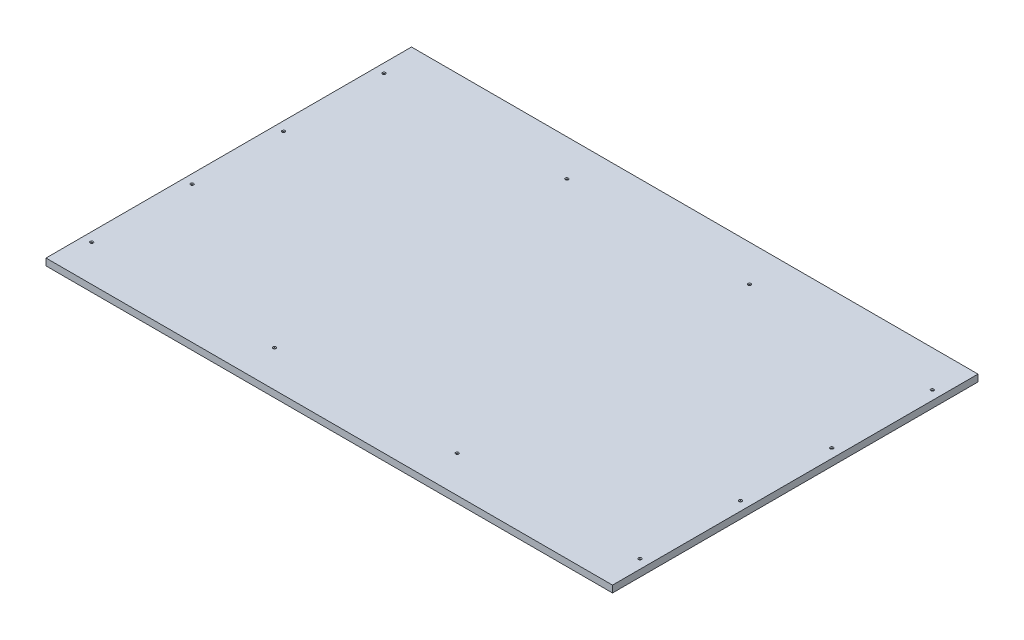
ISO-10303-21;
HEADER;
FILE_DESCRIPTION(('STEP AP214'),'2;1');
FILE_NAME('part.step','',(''),(''),'','','');
FILE_SCHEMA(('AUTOMOTIVE_DESIGN { 1 0 10303 214 1 1 1 1 }'));
ENDSEC;
DATA;
#1=APPLICATION_CONTEXT('core data for automotive mechanical design processes');
#2=APPLICATION_PROTOCOL_DEFINITION('international standard','automotive_design',2000,#1);
#3=PRODUCT_CONTEXT('',#1,'mechanical');
#4=PRODUCT('Part','Part','',(#3));
#5=PRODUCT_RELATED_PRODUCT_CATEGORY('part','',(#4));
#6=PRODUCT_DEFINITION_FORMATION('','',#4);
#7=PRODUCT_DEFINITION_CONTEXT('part definition',#1,'design');
#8=PRODUCT_DEFINITION('design','',#6,#7);
#9=PRODUCT_DEFINITION_SHAPE('','',#8);
#10=(LENGTH_UNIT() NAMED_UNIT(*) SI_UNIT(.MILLI.,.METRE.));
#11=(NAMED_UNIT(*) PLANE_ANGLE_UNIT() SI_UNIT($,.RADIAN.));
#12=(NAMED_UNIT(*) SI_UNIT($,.STERADIAN.) SOLID_ANGLE_UNIT());
#13=UNCERTAINTY_MEASURE_WITH_UNIT(LENGTH_MEASURE(1.E-05),#10,'distance_accuracy_value','');
#14=(GEOMETRIC_REPRESENTATION_CONTEXT(3) GLOBAL_UNCERTAINTY_ASSIGNED_CONTEXT((#13)) GLOBAL_UNIT_ASSIGNED_CONTEXT((#10,
#11,#12)) REPRESENTATION_CONTEXT('',''));
#15=CARTESIAN_POINT('',(0.,0.,0.));
#16=DIRECTION('',(0.,0.,1.));
#17=DIRECTION('',(1.,0.,0.));
#18=AXIS2_PLACEMENT_3D('',#15,#16,#17);
#19=CARTESIAN_POINT('',(-1219.2,19.05,-609.6));
#20=DIRECTION('',(0.,0.,1.));
#21=DIRECTION('',(1.,0.,0.));
#22=AXIS2_PLACEMENT_3D('',#19,#20,#21);
#23=PLANE('',#22);
#24=DIRECTION('',(-1.,0.,0.));
#25=VECTOR('',#24,1.);
#26=CARTESIAN_POINT('',(-1219.2,19.05,-609.6));
#27=LINE('',#26,#25);
#28=CARTESIAN_POINT('',(355.6,19.05,-609.6));
#29=VERTEX_POINT('',#28);
#30=CARTESIAN_POINT('',(-1219.2,19.05,-609.6));
#31=VERTEX_POINT('',#30);
#32=EDGE_CURVE('E55',#29,#31,#27,.T.);
#33=ORIENTED_EDGE('',*,*,#32,.F.);
#34=DIRECTION('',(0.,1.,0.));
#35=VECTOR('',#34,1.);
#36=CARTESIAN_POINT('',(355.6,0.,-609.6));
#37=LINE('',#36,#35);
#38=CARTESIAN_POINT('',(355.6,0.,-609.6));
#39=VERTEX_POINT('',#38);
#40=EDGE_CURVE('E93',#39,#29,#37,.T.);
#41=ORIENTED_EDGE('',*,*,#40,.F.);
#42=DIRECTION('',(-1.,0.,0.));
#43=VECTOR('',#42,1.);
#44=CARTESIAN_POINT('',(-1219.2,0.,-609.6));
#45=LINE('',#44,#43);
#46=CARTESIAN_POINT('',(-1219.2,0.,-609.6));
#47=VERTEX_POINT('',#46);
#48=EDGE_CURVE('E91',#39,#47,#45,.T.);
#49=ORIENTED_EDGE('',*,*,#48,.T.);
#50=DIRECTION('',(0.,-1.,0.));
#51=VECTOR('',#50,1.);
#52=CARTESIAN_POINT('',(-1219.2,19.05,-609.6));
#53=LINE('',#52,#51);
#54=EDGE_CURVE('E11',#31,#47,#53,.T.);
#55=ORIENTED_EDGE('',*,*,#54,.F.);
#56=EDGE_LOOP('',(#33,#41,#49,#55));
#57=FACE_BOUND('',#56,.T.);
#58=ADVANCED_FACE('F32',(#57),#23,.F.);
#59=CARTESIAN_POINT('',(-1219.2,19.05,-609.6));
#60=DIRECTION('',(1.,0.,0.));
#61=DIRECTION('',(0.,0.,-1.));
#62=AXIS2_PLACEMENT_3D('',#59,#60,#61);
#63=PLANE('',#62);
#64=DIRECTION('',(0.,0.,1.));
#65=VECTOR('',#64,1.);
#66=CARTESIAN_POINT('',(-1219.2,0.,-609.6));
#67=LINE('',#66,#65);
#68=CARTESIAN_POINT('',(-1219.2,0.,406.4));
#69=VERTEX_POINT('',#68);
#70=EDGE_CURVE('E87',#47,#69,#67,.T.);
#71=ORIENTED_EDGE('',*,*,#70,.T.);
#72=DIRECTION('',(0.,1.,0.));
#73=VECTOR('',#72,1.);
#74=CARTESIAN_POINT('',(-1219.2,0.,406.4));
#75=LINE('',#74,#73);
#76=CARTESIAN_POINT('',(-1219.2,19.05,406.4));
#77=VERTEX_POINT('',#76);
#78=EDGE_CURVE('E72',#69,#77,#75,.T.);
#79=ORIENTED_EDGE('',*,*,#78,.T.);
#80=DIRECTION('',(0.,0.,1.));
#81=VECTOR('',#80,1.);
#82=CARTESIAN_POINT('',(-1219.2,19.05,-609.6));
#83=LINE('',#82,#81);
#84=EDGE_CURVE('E39',#31,#77,#83,.T.);
#85=ORIENTED_EDGE('',*,*,#84,.F.);
#86=ORIENTED_EDGE('',*,*,#54,.T.);
#87=EDGE_LOOP('',(#71,#79,#85,#86));
#88=FACE_BOUND('',#87,.T.);
#89=ADVANCED_FACE('F90',(#88),#63,.F.);
#90=CARTESIAN_POINT('',(0.,19.05,0.));
#91=DIRECTION('',(0.,1.,0.));
#92=DIRECTION('',(0.,0.,1.));
#93=AXIS2_PLACEMENT_3D('',#90,#91,#92);
#94=PLANE('',#93);
#95=CARTESIAN_POINT('',(-1193.8,19.05,-228.6));
#96=DIRECTION('',(0.,1.,0.));
#97=DIRECTION('',(0.,0.,1.));
#98=AXIS2_PLACEMENT_3D('',#95,#96,#97);
#99=CIRCLE('',#98,4.21640000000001);
#100=CARTESIAN_POINT('',(-1193.8,19.05,-224.3836));
#101=VERTEX_POINT('',#100);
#102=EDGE_CURVE('E208',#101,#101,#99,.T.);
#103=ORIENTED_EDGE('',*,*,#102,.F.);
#104=EDGE_LOOP('',(#103));
#105=FACE_BOUND('',#104,.T.);
#106=CARTESIAN_POINT('',(-1193.8,19.05,25.4000000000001));
#107=DIRECTION('',(0.,1.,0.));
#108=DIRECTION('',(0.,0.,1.));
#109=AXIS2_PLACEMENT_3D('',#106,#107,#108);
#110=CIRCLE('',#109,4.21640000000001);
#111=CARTESIAN_POINT('',(-1193.8,19.05,29.6164000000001));
#112=VERTEX_POINT('',#111);
#113=EDGE_CURVE('E199',#112,#112,#110,.T.);
#114=ORIENTED_EDGE('',*,*,#113,.F.);
#115=EDGE_LOOP('',(#114));
#116=FACE_BOUND('',#115,.T.);
#117=CARTESIAN_POINT('',(330.200000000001,19.05,25.4000000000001));
#118=DIRECTION('',(0.,1.,0.));
#119=DIRECTION('',(0.,0.,1.));
#120=AXIS2_PLACEMENT_3D('',#117,#118,#119);
#121=CIRCLE('',#120,4.21640000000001);
#122=CARTESIAN_POINT('',(330.200000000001,19.05,29.6164000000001));
#123=VERTEX_POINT('',#122);
#124=EDGE_CURVE('E190',#123,#123,#121,.T.);
#125=ORIENTED_EDGE('',*,*,#124,.F.);
#126=EDGE_LOOP('',(#125));
#127=FACE_BOUND('',#126,.T.);
#128=CARTESIAN_POINT('',(330.200000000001,19.05,-228.6));
#129=DIRECTION('',(0.,1.,0.));
#130=DIRECTION('',(0.,0.,1.));
#131=AXIS2_PLACEMENT_3D('',#128,#129,#130);
#132=CIRCLE('',#131,4.21640000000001);
#133=CARTESIAN_POINT('',(330.200000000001,19.05,-224.3836));
#134=VERTEX_POINT('',#133);
#135=EDGE_CURVE('E181',#134,#134,#132,.T.);
#136=ORIENTED_EDGE('',*,*,#135,.F.);
#137=EDGE_LOOP('',(#136));
#138=FACE_BOUND('',#137,.T.);
#139=CARTESIAN_POINT('',(-1193.8,19.05,-508.));
#140=DIRECTION('',(0.,1.,0.));
#141=DIRECTION('',(0.,0.,1.));
#142=AXIS2_PLACEMENT_3D('',#139,#140,#141);
#143=CIRCLE('',#142,4.21640000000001);
#144=CARTESIAN_POINT('',(-1193.8,19.05,-503.7836));
#145=VERTEX_POINT('',#144);
#146=EDGE_CURVE('E172',#145,#145,#143,.T.);
#147=ORIENTED_EDGE('',*,*,#146,.F.);
#148=EDGE_LOOP('',(#147));
#149=FACE_BOUND('',#148,.T.);
#150=CARTESIAN_POINT('',(-685.8,19.05,-508.));
#151=DIRECTION('',(0.,1.,0.));
#152=DIRECTION('',(0.,0.,1.));
#153=AXIS2_PLACEMENT_3D('',#150,#151,#152);
#154=CIRCLE('',#153,4.21640000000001);
#155=CARTESIAN_POINT('',(-685.8,19.05,-503.7836));
#156=VERTEX_POINT('',#155);
#157=EDGE_CURVE('E163',#156,#156,#154,.T.);
#158=ORIENTED_EDGE('',*,*,#157,.F.);
#159=EDGE_LOOP('',(#158));
#160=FACE_BOUND('',#159,.T.);
#161=CARTESIAN_POINT('',(-177.8,19.05,-508.));
#162=DIRECTION('',(0.,1.,0.));
#163=DIRECTION('',(0.,0.,1.));
#164=AXIS2_PLACEMENT_3D('',#161,#162,#163);
#165=CIRCLE('',#164,4.21640000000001);
#166=CARTESIAN_POINT('',(-177.8,19.05,-503.7836));
#167=VERTEX_POINT('',#166);
#168=EDGE_CURVE('E154',#167,#167,#165,.T.);
#169=ORIENTED_EDGE('',*,*,#168,.F.);
#170=EDGE_LOOP('',(#169));
#171=FACE_BOUND('',#170,.T.);
#172=CARTESIAN_POINT('',(330.2,19.05,-508.));
#173=DIRECTION('',(0.,1.,0.));
#174=DIRECTION('',(0.,0.,1.));
#175=AXIS2_PLACEMENT_3D('',#172,#173,#174);
#176=CIRCLE('',#175,4.21640000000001);
#177=CARTESIAN_POINT('',(330.2,19.05,-503.7836));
#178=VERTEX_POINT('',#177);
#179=EDGE_CURVE('E145',#178,#178,#176,.T.);
#180=ORIENTED_EDGE('',*,*,#179,.F.);
#181=EDGE_LOOP('',(#180));
#182=FACE_BOUND('',#181,.T.);
#183=CARTESIAN_POINT('',(-1193.8,19.05,304.8));
#184=DIRECTION('',(0.,1.,0.));
#185=DIRECTION('',(0.,0.,1.));
#186=AXIS2_PLACEMENT_3D('',#183,#184,#185);
#187=CIRCLE('',#186,4.21640000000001);
#188=CARTESIAN_POINT('',(-1193.8,19.05,309.0164));
#189=VERTEX_POINT('',#188);
#190=EDGE_CURVE('E136',#189,#189,#187,.T.);
#191=ORIENTED_EDGE('',*,*,#190,.F.);
#192=EDGE_LOOP('',(#191));
#193=FACE_BOUND('',#192,.T.);
#194=CARTESIAN_POINT('',(-685.8,19.05,304.8));
#195=DIRECTION('',(0.,1.,0.));
#196=DIRECTION('',(0.,0.,1.));
#197=AXIS2_PLACEMENT_3D('',#194,#195,#196);
#198=CIRCLE('',#197,4.21640000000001);
#199=CARTESIAN_POINT('',(-685.8,19.05,309.0164));
#200=VERTEX_POINT('',#199);
#201=EDGE_CURVE('E127',#200,#200,#198,.T.);
#202=ORIENTED_EDGE('',*,*,#201,.F.);
#203=EDGE_LOOP('',(#202));
#204=FACE_BOUND('',#203,.T.);
#205=CARTESIAN_POINT('',(-177.799999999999,19.05,304.8));
#206=DIRECTION('',(0.,1.,0.));
#207=DIRECTION('',(0.,0.,1.));
#208=AXIS2_PLACEMENT_3D('',#205,#206,#207);
#209=CIRCLE('',#208,4.21640000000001);
#210=CARTESIAN_POINT('',(-177.799999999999,19.05,309.0164));
#211=VERTEX_POINT('',#210);
#212=EDGE_CURVE('E118',#211,#211,#209,.T.);
#213=ORIENTED_EDGE('',*,*,#212,.F.);
#214=EDGE_LOOP('',(#213));
#215=FACE_BOUND('',#214,.T.);
#216=CARTESIAN_POINT('',(330.200000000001,19.05,304.8));
#217=DIRECTION('',(0.,1.,0.));
#218=DIRECTION('',(0.,0.,1.));
#219=AXIS2_PLACEMENT_3D('',#216,#217,#218);
#220=CIRCLE('',#219,4.21640000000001);
#221=CARTESIAN_POINT('',(330.200000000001,19.05,309.0164));
#222=VERTEX_POINT('',#221);
#223=EDGE_CURVE('E109',#222,#222,#220,.T.);
#224=ORIENTED_EDGE('',*,*,#223,.F.);
#225=EDGE_LOOP('',(#224));
#226=FACE_BOUND('',#225,.T.);
#227=DIRECTION('',(-1.,0.,0.));
#228=VECTOR('',#227,1.);
#229=CARTESIAN_POINT('',(-1219.2,19.05,406.4));
#230=LINE('',#229,#228);
#231=CARTESIAN_POINT('',(355.6,19.05,406.4));
#232=VERTEX_POINT('',#231);
#233=EDGE_CURVE('E75',#232,#77,#230,.T.);
#234=ORIENTED_EDGE('',*,*,#233,.F.);
#235=DIRECTION('',(0.,0.,1.));
#236=VECTOR('',#235,1.);
#237=CARTESIAN_POINT('',(355.6,19.05,-609.6));
#238=LINE('',#237,#236);
#239=EDGE_CURVE('E79',#29,#232,#238,.T.);
#240=ORIENTED_EDGE('',*,*,#239,.F.);
#241=ORIENTED_EDGE('',*,*,#32,.T.);
#242=ORIENTED_EDGE('',*,*,#84,.T.);
#243=EDGE_LOOP('',(#234,#240,#241,#242));
#244=FACE_BOUND('',#243,.T.);
#245=ADVANCED_FACE('F214',(#105,#116,#127,#138,#149,#160,#171,#182,#193,#204,#215,#226,#244),
#94,.T.);
#246=CARTESIAN_POINT('',(0.,0.,0.));
#247=DIRECTION('',(0.,1.,0.));
#248=DIRECTION('',(0.,0.,1.));
#249=AXIS2_PLACEMENT_3D('',#246,#247,#248);
#250=PLANE('',#249);
#251=CARTESIAN_POINT('',(-1193.8,0.,-228.6));
#252=DIRECTION('',(0.,1.,0.));
#253=DIRECTION('',(0.,0.,1.));
#254=AXIS2_PLACEMENT_3D('',#251,#252,#253);
#255=CIRCLE('',#254,2.24789999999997);
#256=CARTESIAN_POINT('',(-1193.8,0.,-226.3521));
#257=VERTEX_POINT('',#256);
#258=EDGE_CURVE('E202',#257,#257,#255,.T.);
#259=ORIENTED_EDGE('',*,*,#258,.T.);
#260=EDGE_LOOP('',(#259));
#261=FACE_BOUND('',#260,.T.);
#262=CARTESIAN_POINT('',(-1193.8,0.,25.4000000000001));
#263=DIRECTION('',(0.,1.,0.));
#264=DIRECTION('',(0.,0.,1.));
#265=AXIS2_PLACEMENT_3D('',#262,#263,#264);
#266=CIRCLE('',#265,2.24789999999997);
#267=CARTESIAN_POINT('',(-1193.8,0.,27.6479000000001));
#268=VERTEX_POINT('',#267);
#269=EDGE_CURVE('E193',#268,#268,#266,.T.);
#270=ORIENTED_EDGE('',*,*,#269,.T.);
#271=EDGE_LOOP('',(#270));
#272=FACE_BOUND('',#271,.T.);
#273=CARTESIAN_POINT('',(330.200000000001,0.,25.4000000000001));
#274=DIRECTION('',(0.,1.,0.));
#275=DIRECTION('',(0.,0.,1.));
#276=AXIS2_PLACEMENT_3D('',#273,#274,#275);
#277=CIRCLE('',#276,2.24789999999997);
#278=CARTESIAN_POINT('',(330.200000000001,0.,27.6479000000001));
#279=VERTEX_POINT('',#278);
#280=EDGE_CURVE('E184',#279,#279,#277,.T.);
#281=ORIENTED_EDGE('',*,*,#280,.T.);
#282=EDGE_LOOP('',(#281));
#283=FACE_BOUND('',#282,.T.);
#284=CARTESIAN_POINT('',(330.200000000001,0.,-228.6));
#285=DIRECTION('',(0.,1.,0.));
#286=DIRECTION('',(0.,0.,1.));
#287=AXIS2_PLACEMENT_3D('',#284,#285,#286);
#288=CIRCLE('',#287,2.24789999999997);
#289=CARTESIAN_POINT('',(330.200000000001,0.,-226.3521));
#290=VERTEX_POINT('',#289);
#291=EDGE_CURVE('E175',#290,#290,#288,.T.);
#292=ORIENTED_EDGE('',*,*,#291,.T.);
#293=EDGE_LOOP('',(#292));
#294=FACE_BOUND('',#293,.T.);
#295=CARTESIAN_POINT('',(-1193.8,0.,-508.));
#296=DIRECTION('',(0.,1.,0.));
#297=DIRECTION('',(0.,0.,1.));
#298=AXIS2_PLACEMENT_3D('',#295,#296,#297);
#299=CIRCLE('',#298,2.24789999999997);
#300=CARTESIAN_POINT('',(-1193.8,0.,-505.7521));
#301=VERTEX_POINT('',#300);
#302=EDGE_CURVE('E166',#301,#301,#299,.T.);
#303=ORIENTED_EDGE('',*,*,#302,.T.);
#304=EDGE_LOOP('',(#303));
#305=FACE_BOUND('',#304,.T.);
#306=CARTESIAN_POINT('',(-685.8,0.,-508.));
#307=DIRECTION('',(0.,1.,0.));
#308=DIRECTION('',(0.,0.,1.));
#309=AXIS2_PLACEMENT_3D('',#306,#307,#308);
#310=CIRCLE('',#309,2.24789999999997);
#311=CARTESIAN_POINT('',(-685.8,0.,-505.7521));
#312=VERTEX_POINT('',#311);
#313=EDGE_CURVE('E157',#312,#312,#310,.T.);
#314=ORIENTED_EDGE('',*,*,#313,.T.);
#315=EDGE_LOOP('',(#314));
#316=FACE_BOUND('',#315,.T.);
#317=CARTESIAN_POINT('',(-177.8,0.,-508.));
#318=DIRECTION('',(0.,1.,0.));
#319=DIRECTION('',(0.,0.,1.));
#320=AXIS2_PLACEMENT_3D('',#317,#318,#319);
#321=CIRCLE('',#320,2.2479);
#322=CARTESIAN_POINT('',(-177.8,0.,-505.7521));
#323=VERTEX_POINT('',#322);
#324=EDGE_CURVE('E148',#323,#323,#321,.T.);
#325=ORIENTED_EDGE('',*,*,#324,.T.);
#326=EDGE_LOOP('',(#325));
#327=FACE_BOUND('',#326,.T.);
#328=CARTESIAN_POINT('',(330.2,0.,-508.));
#329=DIRECTION('',(0.,1.,0.));
#330=DIRECTION('',(0.,0.,1.));
#331=AXIS2_PLACEMENT_3D('',#328,#329,#330);
#332=CIRCLE('',#331,2.24789999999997);
#333=CARTESIAN_POINT('',(330.2,0.,-505.7521));
#334=VERTEX_POINT('',#333);
#335=EDGE_CURVE('E139',#334,#334,#332,.T.);
#336=ORIENTED_EDGE('',*,*,#335,.T.);
#337=EDGE_LOOP('',(#336));
#338=FACE_BOUND('',#337,.T.);
#339=CARTESIAN_POINT('',(-1193.8,0.,304.8));
#340=DIRECTION('',(0.,1.,0.));
#341=DIRECTION('',(0.,0.,1.));
#342=AXIS2_PLACEMENT_3D('',#339,#340,#341);
#343=CIRCLE('',#342,2.24789999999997);
#344=CARTESIAN_POINT('',(-1193.8,0.,307.0479));
#345=VERTEX_POINT('',#344);
#346=EDGE_CURVE('E130',#345,#345,#343,.T.);
#347=ORIENTED_EDGE('',*,*,#346,.T.);
#348=EDGE_LOOP('',(#347));
#349=FACE_BOUND('',#348,.T.);
#350=CARTESIAN_POINT('',(-685.8,0.,304.8));
#351=DIRECTION('',(0.,1.,0.));
#352=DIRECTION('',(0.,0.,1.));
#353=AXIS2_PLACEMENT_3D('',#350,#351,#352);
#354=CIRCLE('',#353,2.24789999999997);
#355=CARTESIAN_POINT('',(-685.8,0.,307.0479));
#356=VERTEX_POINT('',#355);
#357=EDGE_CURVE('E121',#356,#356,#354,.T.);
#358=ORIENTED_EDGE('',*,*,#357,.T.);
#359=EDGE_LOOP('',(#358));
#360=FACE_BOUND('',#359,.T.);
#361=CARTESIAN_POINT('',(-177.799999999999,0.,304.8));
#362=DIRECTION('',(0.,1.,0.));
#363=DIRECTION('',(0.,0.,1.));
#364=AXIS2_PLACEMENT_3D('',#361,#362,#363);
#365=CIRCLE('',#364,2.2479);
#366=CARTESIAN_POINT('',(-177.799999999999,0.,307.0479));
#367=VERTEX_POINT('',#366);
#368=EDGE_CURVE('E112',#367,#367,#365,.T.);
#369=ORIENTED_EDGE('',*,*,#368,.T.);
#370=EDGE_LOOP('',(#369));
#371=FACE_BOUND('',#370,.T.);
#372=CARTESIAN_POINT('',(330.200000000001,0.,304.8));
#373=DIRECTION('',(0.,1.,0.));
#374=DIRECTION('',(0.,0.,1.));
#375=AXIS2_PLACEMENT_3D('',#372,#373,#374);
#376=CIRCLE('',#375,2.24789999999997);
#377=CARTESIAN_POINT('',(330.200000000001,0.,307.0479));
#378=VERTEX_POINT('',#377);
#379=EDGE_CURVE('E102',#378,#378,#376,.T.);
#380=ORIENTED_EDGE('',*,*,#379,.T.);
#381=EDGE_LOOP('',(#380));
#382=FACE_BOUND('',#381,.T.);
#383=DIRECTION('',(0.,0.,1.));
#384=VECTOR('',#383,1.);
#385=CARTESIAN_POINT('',(355.6,0.,-609.6));
#386=LINE('',#385,#384);
#387=CARTESIAN_POINT('',(355.600000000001,0.,406.4));
#388=VERTEX_POINT('',#387);
#389=EDGE_CURVE('E88',#39,#388,#386,.T.);
#390=ORIENTED_EDGE('',*,*,#389,.T.);
#391=DIRECTION('',(-1.,0.,0.));
#392=VECTOR('',#391,1.);
#393=CARTESIAN_POINT('',(-1219.2,0.,406.4));
#394=LINE('',#393,#392);
#395=EDGE_CURVE('E46',#388,#69,#394,.T.);
#396=ORIENTED_EDGE('',*,*,#395,.T.);
#397=ORIENTED_EDGE('',*,*,#70,.F.);
#398=ORIENTED_EDGE('',*,*,#48,.F.);
#399=EDGE_LOOP('',(#390,#396,#397,#398));
#400=FACE_BOUND('',#399,.T.);
#401=ADVANCED_FACE('F85',(#261,#272,#283,#294,#305,#316,#327,#338,#349,#360,#371,#382,#400),
#250,.F.);
#402=CARTESIAN_POINT('',(355.6,0.,-609.6));
#403=DIRECTION('',(-1.,0.,0.));
#404=DIRECTION('',(0.,0.,1.));
#405=AXIS2_PLACEMENT_3D('',#402,#403,#404);
#406=PLANE('',#405);
#407=ORIENTED_EDGE('',*,*,#239,.T.);
#408=DIRECTION('',(0.,1.,0.));
#409=VECTOR('',#408,1.);
#410=CARTESIAN_POINT('',(355.6,0.,406.4));
#411=LINE('',#410,#409);
#412=EDGE_CURVE('E80',#388,#232,#411,.T.);
#413=ORIENTED_EDGE('',*,*,#412,.F.);
#414=ORIENTED_EDGE('',*,*,#389,.F.);
#415=ORIENTED_EDGE('',*,*,#40,.T.);
#416=EDGE_LOOP('',(#407,#413,#414,#415));
#417=FACE_BOUND('',#416,.T.);
#418=ADVANCED_FACE('F240',(#417),#406,.F.);
#419=CARTESIAN_POINT('',(-1219.2,0.,406.4));
#420=DIRECTION('',(0.,0.,-1.));
#421=DIRECTION('',(-1.,0.,0.));
#422=AXIS2_PLACEMENT_3D('',#419,#420,#421);
#423=PLANE('',#422);
#424=ORIENTED_EDGE('',*,*,#233,.T.);
#425=ORIENTED_EDGE('',*,*,#78,.F.);
#426=ORIENTED_EDGE('',*,*,#395,.F.);
#427=ORIENTED_EDGE('',*,*,#412,.T.);
#428=EDGE_LOOP('',(#424,#425,#426,#427));
#429=FACE_BOUND('',#428,.T.);
#430=ADVANCED_FACE('F73',(#429),#423,.F.);
#431=CARTESIAN_POINT('',(330.200000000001,19.05,304.8));
#432=DIRECTION('',(0.,1.,0.));
#433=DIRECTION('',(0.,0.,1.));
#434=AXIS2_PLACEMENT_3D('',#431,#432,#433);
#435=CYLINDRICAL_SURFACE('',#434,2.24789999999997);
#436=ORIENTED_EDGE('',*,*,#379,.F.);
#437=EDGE_LOOP('',(#436));
#438=FACE_BOUND('',#437,.T.);
#439=CARTESIAN_POINT('',(330.200000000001,17.3982323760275,304.8));
#440=DIRECTION('',(0.,1.,0.));
#441=DIRECTION('',(0.,0.,1.));
#442=AXIS2_PLACEMENT_3D('',#439,#440,#441);
#443=CIRCLE('',#442,2.24789999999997);
#444=CARTESIAN_POINT('',(330.200000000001,17.3982323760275,307.0479));
#445=VERTEX_POINT('',#444);
#446=EDGE_CURVE('E106',#445,#445,#443,.T.);
#447=ORIENTED_EDGE('',*,*,#446,.T.);
#448=EDGE_LOOP('',(#447));
#449=FACE_BOUND('',#448,.T.);
#450=ADVANCED_FACE('F257',(#438,#449),#435,.F.);
#451=CARTESIAN_POINT('',(330.200000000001,19.05,304.8));
#452=DIRECTION('',(0.,1.,0.));
#453=DIRECTION('',(0.,0.,1.));
#454=AXIS2_PLACEMENT_3D('',#451,#452,#453);
#455=CONICAL_SURFACE('',#454,4.21640000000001,0.872664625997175);
#456=ORIENTED_EDGE('',*,*,#446,.F.);
#457=EDGE_LOOP('',(#456));
#458=FACE_BOUND('',#457,.T.);
#459=ORIENTED_EDGE('',*,*,#223,.T.);
#460=EDGE_LOOP('',(#459));
#461=FACE_BOUND('',#460,.T.);
#462=ADVANCED_FACE('F260',(#458,#461),#455,.F.);
#463=CARTESIAN_POINT('',(-177.799999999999,19.05,304.8));
#464=DIRECTION('',(0.,1.,0.));
#465=DIRECTION('',(0.,0.,1.));
#466=AXIS2_PLACEMENT_3D('',#463,#464,#465);
#467=CYLINDRICAL_SURFACE('',#466,2.2479);
#468=ORIENTED_EDGE('',*,*,#368,.F.);
#469=EDGE_LOOP('',(#468));
#470=FACE_BOUND('',#469,.T.);
#471=CARTESIAN_POINT('',(-177.799999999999,17.3982323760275,304.8));
#472=DIRECTION('',(0.,1.,0.));
#473=DIRECTION('',(0.,0.,1.));
#474=AXIS2_PLACEMENT_3D('',#471,#472,#473);
#475=CIRCLE('',#474,2.2479);
#476=CARTESIAN_POINT('',(-177.799999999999,17.3982323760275,307.0479));
#477=VERTEX_POINT('',#476);
#478=EDGE_CURVE('E115',#477,#477,#475,.T.);
#479=ORIENTED_EDGE('',*,*,#478,.T.);
#480=EDGE_LOOP('',(#479));
#481=FACE_BOUND('',#480,.T.);
#482=ADVANCED_FACE('F264',(#470,#481),#467,.F.);
#483=CARTESIAN_POINT('',(-177.799999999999,19.05,304.8));
#484=DIRECTION('',(0.,1.,0.));
#485=DIRECTION('',(0.,0.,1.));
#486=AXIS2_PLACEMENT_3D('',#483,#484,#485);
#487=CONICAL_SURFACE('',#486,4.21640000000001,0.872664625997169);
#488=ORIENTED_EDGE('',*,*,#478,.F.);
#489=EDGE_LOOP('',(#488));
#490=FACE_BOUND('',#489,.T.);
#491=ORIENTED_EDGE('',*,*,#212,.T.);
#492=EDGE_LOOP('',(#491));
#493=FACE_BOUND('',#492,.T.);
#494=ADVANCED_FACE('F268',(#490,#493),#487,.F.);
#495=CARTESIAN_POINT('',(-685.8,19.05,304.8));
#496=DIRECTION('',(0.,1.,0.));
#497=DIRECTION('',(0.,0.,1.));
#498=AXIS2_PLACEMENT_3D('',#495,#496,#497);
#499=CYLINDRICAL_SURFACE('',#498,2.24789999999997);
#500=ORIENTED_EDGE('',*,*,#357,.F.);
#501=EDGE_LOOP('',(#500));
#502=FACE_BOUND('',#501,.T.);
#503=CARTESIAN_POINT('',(-685.8,17.3982323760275,304.8));
#504=DIRECTION('',(0.,1.,0.));
#505=DIRECTION('',(0.,0.,1.));
#506=AXIS2_PLACEMENT_3D('',#503,#504,#505);
#507=CIRCLE('',#506,2.24789999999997);
#508=CARTESIAN_POINT('',(-685.8,17.3982323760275,307.0479));
#509=VERTEX_POINT('',#508);
#510=EDGE_CURVE('E124',#509,#509,#507,.T.);
#511=ORIENTED_EDGE('',*,*,#510,.T.);
#512=EDGE_LOOP('',(#511));
#513=FACE_BOUND('',#512,.T.);
#514=ADVANCED_FACE('F272',(#502,#513),#499,.F.);
#515=CARTESIAN_POINT('',(-685.8,19.05,304.8));
#516=DIRECTION('',(0.,1.,0.));
#517=DIRECTION('',(0.,0.,1.));
#518=AXIS2_PLACEMENT_3D('',#515,#516,#517);
#519=CONICAL_SURFACE('',#518,4.21640000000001,0.872664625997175);
#520=ORIENTED_EDGE('',*,*,#510,.F.);
#521=EDGE_LOOP('',(#520));
#522=FACE_BOUND('',#521,.T.);
#523=ORIENTED_EDGE('',*,*,#201,.T.);
#524=EDGE_LOOP('',(#523));
#525=FACE_BOUND('',#524,.T.);
#526=ADVANCED_FACE('F276',(#522,#525),#519,.F.);
#527=CARTESIAN_POINT('',(-1193.8,19.05,304.8));
#528=DIRECTION('',(0.,1.,0.));
#529=DIRECTION('',(0.,0.,1.));
#530=AXIS2_PLACEMENT_3D('',#527,#528,#529);
#531=CYLINDRICAL_SURFACE('',#530,2.24789999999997);
#532=ORIENTED_EDGE('',*,*,#346,.F.);
#533=EDGE_LOOP('',(#532));
#534=FACE_BOUND('',#533,.T.);
#535=CARTESIAN_POINT('',(-1193.8,17.3982323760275,304.8));
#536=DIRECTION('',(0.,1.,0.));
#537=DIRECTION('',(0.,0.,1.));
#538=AXIS2_PLACEMENT_3D('',#535,#536,#537);
#539=CIRCLE('',#538,2.24789999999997);
#540=CARTESIAN_POINT('',(-1193.8,17.3982323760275,307.0479));
#541=VERTEX_POINT('',#540);
#542=EDGE_CURVE('E133',#541,#541,#539,.T.);
#543=ORIENTED_EDGE('',*,*,#542,.T.);
#544=EDGE_LOOP('',(#543));
#545=FACE_BOUND('',#544,.T.);
#546=ADVANCED_FACE('F280',(#534,#545),#531,.F.);
#547=CARTESIAN_POINT('',(-1193.8,19.05,304.8));
#548=DIRECTION('',(0.,1.,0.));
#549=DIRECTION('',(0.,0.,1.));
#550=AXIS2_PLACEMENT_3D('',#547,#548,#549);
#551=CONICAL_SURFACE('',#550,4.21640000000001,0.872664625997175);
#552=ORIENTED_EDGE('',*,*,#542,.F.);
#553=EDGE_LOOP('',(#552));
#554=FACE_BOUND('',#553,.T.);
#555=ORIENTED_EDGE('',*,*,#190,.T.);
#556=EDGE_LOOP('',(#555));
#557=FACE_BOUND('',#556,.T.);
#558=ADVANCED_FACE('F284',(#554,#557),#551,.F.);
#559=CARTESIAN_POINT('',(330.2,19.05,-508.));
#560=DIRECTION('',(0.,1.,0.));
#561=DIRECTION('',(0.,0.,1.));
#562=AXIS2_PLACEMENT_3D('',#559,#560,#561);
#563=CYLINDRICAL_SURFACE('',#562,2.24789999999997);
#564=ORIENTED_EDGE('',*,*,#335,.F.);
#565=EDGE_LOOP('',(#564));
#566=FACE_BOUND('',#565,.T.);
#567=CARTESIAN_POINT('',(330.2,17.3982323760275,-508.));
#568=DIRECTION('',(0.,1.,0.));
#569=DIRECTION('',(0.,0.,1.));
#570=AXIS2_PLACEMENT_3D('',#567,#568,#569);
#571=CIRCLE('',#570,2.24789999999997);
#572=CARTESIAN_POINT('',(330.2,17.3982323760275,-505.7521));
#573=VERTEX_POINT('',#572);
#574=EDGE_CURVE('E142',#573,#573,#571,.T.);
#575=ORIENTED_EDGE('',*,*,#574,.T.);
#576=EDGE_LOOP('',(#575));
#577=FACE_BOUND('',#576,.T.);
#578=ADVANCED_FACE('F288',(#566,#577),#563,.F.);
#579=CARTESIAN_POINT('',(330.2,19.05,-508.));
#580=DIRECTION('',(0.,1.,0.));
#581=DIRECTION('',(0.,0.,1.));
#582=AXIS2_PLACEMENT_3D('',#579,#580,#581);
#583=CONICAL_SURFACE('',#582,4.21640000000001,0.872664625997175);
#584=ORIENTED_EDGE('',*,*,#574,.F.);
#585=EDGE_LOOP('',(#584));
#586=FACE_BOUND('',#585,.T.);
#587=ORIENTED_EDGE('',*,*,#179,.T.);
#588=EDGE_LOOP('',(#587));
#589=FACE_BOUND('',#588,.T.);
#590=ADVANCED_FACE('F292',(#586,#589),#583,.F.);
#591=CARTESIAN_POINT('',(-177.8,19.05,-508.));
#592=DIRECTION('',(0.,1.,0.));
#593=DIRECTION('',(0.,0.,1.));
#594=AXIS2_PLACEMENT_3D('',#591,#592,#593);
#595=CYLINDRICAL_SURFACE('',#594,2.2479);
#596=ORIENTED_EDGE('',*,*,#324,.F.);
#597=EDGE_LOOP('',(#596));
#598=FACE_BOUND('',#597,.T.);
#599=CARTESIAN_POINT('',(-177.8,17.3982323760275,-508.));
#600=DIRECTION('',(0.,1.,0.));
#601=DIRECTION('',(0.,0.,1.));
#602=AXIS2_PLACEMENT_3D('',#599,#600,#601);
#603=CIRCLE('',#602,2.2479);
#604=CARTESIAN_POINT('',(-177.8,17.3982323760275,-505.7521));
#605=VERTEX_POINT('',#604);
#606=EDGE_CURVE('E151',#605,#605,#603,.T.);
#607=ORIENTED_EDGE('',*,*,#606,.T.);
#608=EDGE_LOOP('',(#607));
#609=FACE_BOUND('',#608,.T.);
#610=ADVANCED_FACE('F296',(#598,#609),#595,.F.);
#611=CARTESIAN_POINT('',(-177.8,19.05,-508.));
#612=DIRECTION('',(0.,1.,0.));
#613=DIRECTION('',(0.,0.,1.));
#614=AXIS2_PLACEMENT_3D('',#611,#612,#613);
#615=CONICAL_SURFACE('',#614,4.21640000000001,0.872664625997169);
#616=ORIENTED_EDGE('',*,*,#606,.F.);
#617=EDGE_LOOP('',(#616));
#618=FACE_BOUND('',#617,.T.);
#619=ORIENTED_EDGE('',*,*,#168,.T.);
#620=EDGE_LOOP('',(#619));
#621=FACE_BOUND('',#620,.T.);
#622=ADVANCED_FACE('F300',(#618,#621),#615,.F.);
#623=CARTESIAN_POINT('',(-685.8,19.05,-508.));
#624=DIRECTION('',(0.,1.,0.));
#625=DIRECTION('',(0.,0.,1.));
#626=AXIS2_PLACEMENT_3D('',#623,#624,#625);
#627=CYLINDRICAL_SURFACE('',#626,2.24789999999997);
#628=ORIENTED_EDGE('',*,*,#313,.F.);
#629=EDGE_LOOP('',(#628));
#630=FACE_BOUND('',#629,.T.);
#631=CARTESIAN_POINT('',(-685.8,17.3982323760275,-508.));
#632=DIRECTION('',(0.,1.,0.));
#633=DIRECTION('',(0.,0.,1.));
#634=AXIS2_PLACEMENT_3D('',#631,#632,#633);
#635=CIRCLE('',#634,2.24789999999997);
#636=CARTESIAN_POINT('',(-685.8,17.3982323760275,-505.7521));
#637=VERTEX_POINT('',#636);
#638=EDGE_CURVE('E160',#637,#637,#635,.T.);
#639=ORIENTED_EDGE('',*,*,#638,.T.);
#640=EDGE_LOOP('',(#639));
#641=FACE_BOUND('',#640,.T.);
#642=ADVANCED_FACE('F304',(#630,#641),#627,.F.);
#643=CARTESIAN_POINT('',(-685.8,19.05,-508.));
#644=DIRECTION('',(0.,1.,0.));
#645=DIRECTION('',(0.,0.,1.));
#646=AXIS2_PLACEMENT_3D('',#643,#644,#645);
#647=CONICAL_SURFACE('',#646,4.21640000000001,0.872664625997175);
#648=ORIENTED_EDGE('',*,*,#638,.F.);
#649=EDGE_LOOP('',(#648));
#650=FACE_BOUND('',#649,.T.);
#651=ORIENTED_EDGE('',*,*,#157,.T.);
#652=EDGE_LOOP('',(#651));
#653=FACE_BOUND('',#652,.T.);
#654=ADVANCED_FACE('F308',(#650,#653),#647,.F.);
#655=CARTESIAN_POINT('',(-1193.8,19.05,-508.));
#656=DIRECTION('',(0.,1.,0.));
#657=DIRECTION('',(0.,0.,1.));
#658=AXIS2_PLACEMENT_3D('',#655,#656,#657);
#659=CYLINDRICAL_SURFACE('',#658,2.24789999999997);
#660=ORIENTED_EDGE('',*,*,#302,.F.);
#661=EDGE_LOOP('',(#660));
#662=FACE_BOUND('',#661,.T.);
#663=CARTESIAN_POINT('',(-1193.8,17.3982323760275,-508.));
#664=DIRECTION('',(0.,1.,0.));
#665=DIRECTION('',(0.,0.,1.));
#666=AXIS2_PLACEMENT_3D('',#663,#664,#665);
#667=CIRCLE('',#666,2.24789999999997);
#668=CARTESIAN_POINT('',(-1193.8,17.3982323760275,-505.7521));
#669=VERTEX_POINT('',#668);
#670=EDGE_CURVE('E169',#669,#669,#667,.T.);
#671=ORIENTED_EDGE('',*,*,#670,.T.);
#672=EDGE_LOOP('',(#671));
#673=FACE_BOUND('',#672,.T.);
#674=ADVANCED_FACE('F312',(#662,#673),#659,.F.);
#675=CARTESIAN_POINT('',(-1193.8,19.05,-508.));
#676=DIRECTION('',(0.,1.,0.));
#677=DIRECTION('',(0.,0.,1.));
#678=AXIS2_PLACEMENT_3D('',#675,#676,#677);
#679=CONICAL_SURFACE('',#678,4.21640000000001,0.872664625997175);
#680=ORIENTED_EDGE('',*,*,#670,.F.);
#681=EDGE_LOOP('',(#680));
#682=FACE_BOUND('',#681,.T.);
#683=ORIENTED_EDGE('',*,*,#146,.T.);
#684=EDGE_LOOP('',(#683));
#685=FACE_BOUND('',#684,.T.);
#686=ADVANCED_FACE('F316',(#682,#685),#679,.F.);
#687=CARTESIAN_POINT('',(330.200000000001,19.05,-228.6));
#688=DIRECTION('',(0.,1.,0.));
#689=DIRECTION('',(0.,0.,1.));
#690=AXIS2_PLACEMENT_3D('',#687,#688,#689);
#691=CYLINDRICAL_SURFACE('',#690,2.24789999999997);
#692=ORIENTED_EDGE('',*,*,#291,.F.);
#693=EDGE_LOOP('',(#692));
#694=FACE_BOUND('',#693,.T.);
#695=CARTESIAN_POINT('',(330.200000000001,17.3982323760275,-228.6));
#696=DIRECTION('',(0.,1.,0.));
#697=DIRECTION('',(0.,0.,1.));
#698=AXIS2_PLACEMENT_3D('',#695,#696,#697);
#699=CIRCLE('',#698,2.24789999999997);
#700=CARTESIAN_POINT('',(330.200000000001,17.3982323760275,-226.3521));
#701=VERTEX_POINT('',#700);
#702=EDGE_CURVE('E178',#701,#701,#699,.T.);
#703=ORIENTED_EDGE('',*,*,#702,.T.);
#704=EDGE_LOOP('',(#703));
#705=FACE_BOUND('',#704,.T.);
#706=ADVANCED_FACE('F320',(#694,#705),#691,.F.);
#707=CARTESIAN_POINT('',(330.200000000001,19.05,-228.6));
#708=DIRECTION('',(0.,1.,0.));
#709=DIRECTION('',(0.,0.,1.));
#710=AXIS2_PLACEMENT_3D('',#707,#708,#709);
#711=CONICAL_SURFACE('',#710,4.21640000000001,0.872664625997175);
#712=ORIENTED_EDGE('',*,*,#702,.F.);
#713=EDGE_LOOP('',(#712));
#714=FACE_BOUND('',#713,.T.);
#715=ORIENTED_EDGE('',*,*,#135,.T.);
#716=EDGE_LOOP('',(#715));
#717=FACE_BOUND('',#716,.T.);
#718=ADVANCED_FACE('F324',(#714,#717),#711,.F.);
#719=CARTESIAN_POINT('',(330.200000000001,19.05,25.4000000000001));
#720=DIRECTION('',(0.,1.,0.));
#721=DIRECTION('',(0.,0.,1.));
#722=AXIS2_PLACEMENT_3D('',#719,#720,#721);
#723=CYLINDRICAL_SURFACE('',#722,2.24789999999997);
#724=ORIENTED_EDGE('',*,*,#280,.F.);
#725=EDGE_LOOP('',(#724));
#726=FACE_BOUND('',#725,.T.);
#727=CARTESIAN_POINT('',(330.200000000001,17.3982323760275,25.4000000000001));
#728=DIRECTION('',(0.,1.,0.));
#729=DIRECTION('',(0.,0.,1.));
#730=AXIS2_PLACEMENT_3D('',#727,#728,#729);
#731=CIRCLE('',#730,2.24789999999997);
#732=CARTESIAN_POINT('',(330.200000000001,17.3982323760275,27.6479000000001));
#733=VERTEX_POINT('',#732);
#734=EDGE_CURVE('E187',#733,#733,#731,.T.);
#735=ORIENTED_EDGE('',*,*,#734,.T.);
#736=EDGE_LOOP('',(#735));
#737=FACE_BOUND('',#736,.T.);
#738=ADVANCED_FACE('F328',(#726,#737),#723,.F.);
#739=CARTESIAN_POINT('',(330.200000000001,19.05,25.4000000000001));
#740=DIRECTION('',(0.,1.,0.));
#741=DIRECTION('',(0.,0.,1.));
#742=AXIS2_PLACEMENT_3D('',#739,#740,#741);
#743=CONICAL_SURFACE('',#742,4.21640000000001,0.872664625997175);
#744=ORIENTED_EDGE('',*,*,#734,.F.);
#745=EDGE_LOOP('',(#744));
#746=FACE_BOUND('',#745,.T.);
#747=ORIENTED_EDGE('',*,*,#124,.T.);
#748=EDGE_LOOP('',(#747));
#749=FACE_BOUND('',#748,.T.);
#750=ADVANCED_FACE('F332',(#746,#749),#743,.F.);
#751=CARTESIAN_POINT('',(-1193.8,19.05,25.4000000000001));
#752=DIRECTION('',(0.,1.,0.));
#753=DIRECTION('',(0.,0.,1.));
#754=AXIS2_PLACEMENT_3D('',#751,#752,#753);
#755=CYLINDRICAL_SURFACE('',#754,2.24789999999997);
#756=ORIENTED_EDGE('',*,*,#269,.F.);
#757=EDGE_LOOP('',(#756));
#758=FACE_BOUND('',#757,.T.);
#759=CARTESIAN_POINT('',(-1193.8,17.3982323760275,25.4000000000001));
#760=DIRECTION('',(0.,1.,0.));
#761=DIRECTION('',(0.,0.,1.));
#762=AXIS2_PLACEMENT_3D('',#759,#760,#761);
#763=CIRCLE('',#762,2.24789999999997);
#764=CARTESIAN_POINT('',(-1193.8,17.3982323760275,27.6479000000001));
#765=VERTEX_POINT('',#764);
#766=EDGE_CURVE('E196',#765,#765,#763,.T.);
#767=ORIENTED_EDGE('',*,*,#766,.T.);
#768=EDGE_LOOP('',(#767));
#769=FACE_BOUND('',#768,.T.);
#770=ADVANCED_FACE('F336',(#758,#769),#755,.F.);
#771=CARTESIAN_POINT('',(-1193.8,19.05,25.4000000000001));
#772=DIRECTION('',(0.,1.,0.));
#773=DIRECTION('',(0.,0.,1.));
#774=AXIS2_PLACEMENT_3D('',#771,#772,#773);
#775=CONICAL_SURFACE('',#774,4.21640000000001,0.872664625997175);
#776=ORIENTED_EDGE('',*,*,#766,.F.);
#777=EDGE_LOOP('',(#776));
#778=FACE_BOUND('',#777,.T.);
#779=ORIENTED_EDGE('',*,*,#113,.T.);
#780=EDGE_LOOP('',(#779));
#781=FACE_BOUND('',#780,.T.);
#782=ADVANCED_FACE('F340',(#778,#781),#775,.F.);
#783=CARTESIAN_POINT('',(-1193.8,19.05,-228.6));
#784=DIRECTION('',(0.,1.,0.));
#785=DIRECTION('',(0.,0.,1.));
#786=AXIS2_PLACEMENT_3D('',#783,#784,#785);
#787=CYLINDRICAL_SURFACE('',#786,2.24789999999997);
#788=ORIENTED_EDGE('',*,*,#258,.F.);
#789=EDGE_LOOP('',(#788));
#790=FACE_BOUND('',#789,.T.);
#791=CARTESIAN_POINT('',(-1193.8,17.3982323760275,-228.6));
#792=DIRECTION('',(0.,1.,0.));
#793=DIRECTION('',(0.,0.,1.));
#794=AXIS2_PLACEMENT_3D('',#791,#792,#793);
#795=CIRCLE('',#794,2.24789999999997);
#796=CARTESIAN_POINT('',(-1193.8,17.3982323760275,-226.3521));
#797=VERTEX_POINT('',#796);
#798=EDGE_CURVE('E205',#797,#797,#795,.T.);
#799=ORIENTED_EDGE('',*,*,#798,.T.);
#800=EDGE_LOOP('',(#799));
#801=FACE_BOUND('',#800,.T.);
#802=ADVANCED_FACE('F344',(#790,#801),#787,.F.);
#803=CARTESIAN_POINT('',(-1193.8,19.05,-228.6));
#804=DIRECTION('',(0.,1.,0.));
#805=DIRECTION('',(0.,0.,1.));
#806=AXIS2_PLACEMENT_3D('',#803,#804,#805);
#807=CONICAL_SURFACE('',#806,4.21640000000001,0.872664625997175);
#808=ORIENTED_EDGE('',*,*,#798,.F.);
#809=EDGE_LOOP('',(#808));
#810=FACE_BOUND('',#809,.T.);
#811=ORIENTED_EDGE('',*,*,#102,.T.);
#812=EDGE_LOOP('',(#811));
#813=FACE_BOUND('',#812,.T.);
#814=ADVANCED_FACE('F212',(#810,#813),#807,.F.);
#815=CLOSED_SHELL('',(#58,#89,#245,#401,#418,#430,#450,#462,#482,#494,#514,#526,#546,#558,#578,
#590,#610,#622,#642,#654,#674,#686,#706,#718,#738,#750,#770,#782,#802,#814));
#816=MANIFOLD_SOLID_BREP('B2',#815);
#817=ADVANCED_BREP_SHAPE_REPRESENTATION('',(#18,#816),#14);
#818=SHAPE_DEFINITION_REPRESENTATION(#9,#817);
ENDSEC;
END-ISO-10303-21;
